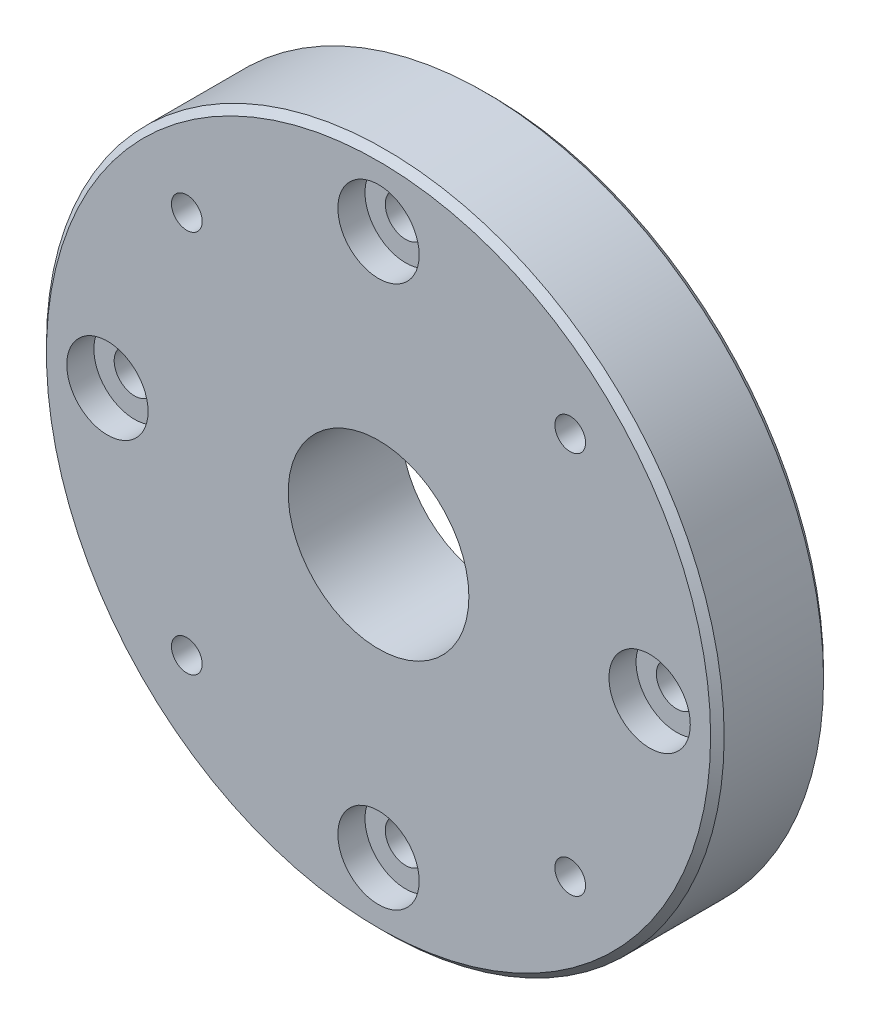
ISO-10303-21;
HEADER;
FILE_DESCRIPTION(('STEP AP214'),'2;1');
FILE_NAME('part.step','',(''),(''),'','','');
FILE_SCHEMA(('AUTOMOTIVE_DESIGN { 1 0 10303 214 1 1 1 1 }'));
ENDSEC;
DATA;
#1=APPLICATION_CONTEXT('core data for automotive mechanical design processes');
#2=APPLICATION_PROTOCOL_DEFINITION('international standard','automotive_design',2000,#1);
#3=PRODUCT_CONTEXT('',#1,'mechanical');
#4=PRODUCT('Part','Part','',(#3));
#5=PRODUCT_RELATED_PRODUCT_CATEGORY('part','',(#4));
#6=PRODUCT_DEFINITION_FORMATION('','',#4);
#7=PRODUCT_DEFINITION_CONTEXT('part definition',#1,'design');
#8=PRODUCT_DEFINITION('design','',#6,#7);
#9=PRODUCT_DEFINITION_SHAPE('','',#8);
#10=(LENGTH_UNIT() NAMED_UNIT(*) SI_UNIT(.MILLI.,.METRE.));
#11=(NAMED_UNIT(*) PLANE_ANGLE_UNIT() SI_UNIT($,.RADIAN.));
#12=(NAMED_UNIT(*) SI_UNIT($,.STERADIAN.) SOLID_ANGLE_UNIT());
#13=UNCERTAINTY_MEASURE_WITH_UNIT(LENGTH_MEASURE(1.E-05),#10,'distance_accuracy_value','');
#14=(GEOMETRIC_REPRESENTATION_CONTEXT(3) GLOBAL_UNCERTAINTY_ASSIGNED_CONTEXT((#13)) GLOBAL_UNIT_ASSIGNED_CONTEXT((#10,
#11,#12)) REPRESENTATION_CONTEXT('',''));
#15=CARTESIAN_POINT('',(0.,0.,0.));
#16=DIRECTION('',(0.,0.,1.));
#17=DIRECTION('',(1.,0.,0.));
#18=AXIS2_PLACEMENT_3D('',#15,#16,#17);
#19=CARTESIAN_POINT('',(0.,0.,25.));
#20=DIRECTION('',(0.,0.,-1.));
#21=DIRECTION('',(-1.,0.,0.));
#22=AXIS2_PLACEMENT_3D('',#19,#20,#21);
#23=CYLINDRICAL_SURFACE('',#22,75.);
#24=CARTESIAN_POINT('',(0.,0.,1.50000000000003));
#25=DIRECTION('',(0.,0.,1.));
#26=DIRECTION('',(1.,0.,0.));
#27=AXIS2_PLACEMENT_3D('',#24,#25,#26);
#28=CIRCLE('',#27,75.);
#29=CARTESIAN_POINT('',(75.,0.,1.50000000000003));
#30=VERTEX_POINT('',#29);
#31=EDGE_CURVE('E60',#30,#30,#28,.T.);
#32=ORIENTED_EDGE('',*,*,#31,.T.);
#33=EDGE_LOOP('',(#32));
#34=FACE_BOUND('',#33,.T.);
#35=CARTESIAN_POINT('',(0.,0.,23.5000000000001));
#36=DIRECTION('',(0.,0.,1.));
#37=DIRECTION('',(1.,0.,0.));
#38=AXIS2_PLACEMENT_3D('',#35,#36,#37);
#39=CIRCLE('',#38,75.);
#40=CARTESIAN_POINT('',(75.,0.,23.5000000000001));
#41=VERTEX_POINT('',#40);
#42=EDGE_CURVE('E64',#41,#41,#39,.F.);
#43=ORIENTED_EDGE('',*,*,#42,.T.);
#44=EDGE_LOOP('',(#43));
#45=FACE_BOUND('',#44,.T.);
#46=ADVANCED_FACE('F48',(#34,#45),#23,.T.);
#47=CARTESIAN_POINT('',(0.,0.,25.));
#48=DIRECTION('',(0.,0.,1.));
#49=DIRECTION('',(1.,0.,0.));
#50=AXIS2_PLACEMENT_3D('',#47,#48,#49);
#51=PLANE('',#50);
#52=CARTESIAN_POINT('',(0.,0.,25.));
#53=DIRECTION('',(0.,0.,1.));
#54=DIRECTION('',(1.,0.,0.));
#55=AXIS2_PLACEMENT_3D('',#52,#53,#54);
#56=CIRCLE('',#55,20.);
#57=CARTESIAN_POINT('',(20.,0.,25.));
#58=VERTEX_POINT('',#57);
#59=EDGE_CURVE('E142',#58,#58,#56,.T.);
#60=ORIENTED_EDGE('',*,*,#59,.F.);
#61=EDGE_LOOP('',(#60));
#62=FACE_BOUND('',#61,.T.);
#63=CARTESIAN_POINT('',(0.,0.,25.));
#64=DIRECTION('',(0.,0.,1.));
#65=DIRECTION('',(1.,0.,0.));
#66=AXIS2_PLACEMENT_3D('',#63,#64,#65);
#67=CIRCLE('',#66,73.5);
#68=CARTESIAN_POINT('',(73.5,0.,25.));
#69=VERTEX_POINT('',#68);
#70=EDGE_CURVE('E12',#69,#69,#67,.T.);
#71=ORIENTED_EDGE('',*,*,#70,.T.);
#72=EDGE_LOOP('',(#71));
#73=FACE_BOUND('',#72,.T.);
#74=CARTESIAN_POINT('',(42.4264068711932,-42.4264068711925,25.));
#75=DIRECTION('',(0.,0.,1.));
#76=DIRECTION('',(1.,0.,0.));
#77=AXIS2_PLACEMENT_3D('',#74,#75,#76);
#78=CIRCLE('',#77,3.4);
#79=CARTESIAN_POINT('',(45.8264068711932,-42.4264068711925,25.));
#80=VERTEX_POINT('',#79);
#81=EDGE_CURVE('E138',#80,#80,#78,.T.);
#82=ORIENTED_EDGE('',*,*,#81,.F.);
#83=EDGE_LOOP('',(#82));
#84=FACE_BOUND('',#83,.T.);
#85=CARTESIAN_POINT('',(-42.4264068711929,-42.4264068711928,25.));
#86=DIRECTION('',(0.,0.,1.));
#87=DIRECTION('',(1.,0.,0.));
#88=AXIS2_PLACEMENT_3D('',#85,#86,#87);
#89=CIRCLE('',#88,3.4);
#90=CARTESIAN_POINT('',(-39.0264068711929,-42.4264068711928,25.));
#91=VERTEX_POINT('',#90);
#92=EDGE_CURVE('E132',#91,#91,#89,.T.);
#93=ORIENTED_EDGE('',*,*,#92,.F.);
#94=EDGE_LOOP('',(#93));
#95=FACE_BOUND('',#94,.T.);
#96=CARTESIAN_POINT('',(-42.4264068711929,42.4264068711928,25.));
#97=DIRECTION('',(0.,0.,1.));
#98=DIRECTION('',(1.,0.,0.));
#99=AXIS2_PLACEMENT_3D('',#96,#97,#98);
#100=CIRCLE('',#99,3.4);
#101=CARTESIAN_POINT('',(-39.0264068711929,42.4264068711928,25.));
#102=VERTEX_POINT('',#101);
#103=EDGE_CURVE('E126',#102,#102,#100,.T.);
#104=ORIENTED_EDGE('',*,*,#103,.F.);
#105=EDGE_LOOP('',(#104));
#106=FACE_BOUND('',#105,.T.);
#107=CARTESIAN_POINT('',(60.,6.28466640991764E-13,25.));
#108=DIRECTION('',(0.,0.,1.));
#109=DIRECTION('',(1.,0.,0.));
#110=AXIS2_PLACEMENT_3D('',#107,#108,#109);
#111=CIRCLE('',#110,8.99999999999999);
#112=CARTESIAN_POINT('',(69.,6.28466640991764E-13,25.));
#113=VERTEX_POINT('',#112);
#114=EDGE_CURVE('E120',#113,#113,#111,.T.);
#115=ORIENTED_EDGE('',*,*,#114,.F.);
#116=EDGE_LOOP('',(#115));
#117=FACE_BOUND('',#116,.T.);
#118=CARTESIAN_POINT('',(0.,-60.,25.));
#119=DIRECTION('',(0.,0.,1.));
#120=DIRECTION('',(1.,0.,0.));
#121=AXIS2_PLACEMENT_3D('',#118,#119,#120);
#122=CIRCLE('',#121,9.);
#123=CARTESIAN_POINT('',(9.,-60.,25.));
#124=VERTEX_POINT('',#123);
#125=EDGE_CURVE('E108',#124,#124,#122,.T.);
#126=ORIENTED_EDGE('',*,*,#125,.F.);
#127=EDGE_LOOP('',(#126));
#128=FACE_BOUND('',#127,.T.);
#129=CARTESIAN_POINT('',(-60.,-2.09488880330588E-13,25.));
#130=DIRECTION('',(0.,0.,1.));
#131=DIRECTION('',(1.,0.,0.));
#132=AXIS2_PLACEMENT_3D('',#129,#130,#131);
#133=CIRCLE('',#132,8.99999999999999);
#134=CARTESIAN_POINT('',(-51.,-2.09488880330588E-13,25.));
#135=VERTEX_POINT('',#134);
#136=EDGE_CURVE('E96',#135,#135,#133,.T.);
#137=ORIENTED_EDGE('',*,*,#136,.F.);
#138=EDGE_LOOP('',(#137));
#139=FACE_BOUND('',#138,.T.);
#140=CARTESIAN_POINT('',(42.4264068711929,42.4264068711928,25.));
#141=DIRECTION('',(0.,0.,1.));
#142=DIRECTION('',(1.,0.,0.));
#143=AXIS2_PLACEMENT_3D('',#140,#141,#142);
#144=CIRCLE('',#143,3.4);
#145=CARTESIAN_POINT('',(45.8264068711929,42.4264068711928,25.));
#146=VERTEX_POINT('',#145);
#147=EDGE_CURVE('E84',#146,#146,#144,.T.);
#148=ORIENTED_EDGE('',*,*,#147,.F.);
#149=EDGE_LOOP('',(#148));
#150=FACE_BOUND('',#149,.T.);
#151=CARTESIAN_POINT('',(0.,60.,25.));
#152=DIRECTION('',(0.,0.,1.));
#153=DIRECTION('',(1.,0.,0.));
#154=AXIS2_PLACEMENT_3D('',#151,#152,#153);
#155=CIRCLE('',#154,9.);
#156=CARTESIAN_POINT('',(9.,60.,25.));
#157=VERTEX_POINT('',#156);
#158=EDGE_CURVE('E78',#157,#157,#155,.T.);
#159=ORIENTED_EDGE('',*,*,#158,.F.);
#160=EDGE_LOOP('',(#159));
#161=FACE_BOUND('',#160,.T.);
#162=ADVANCED_FACE('F156',(#62,#73,#84,#95,#106,#117,#128,#139,#150,#161),#51,.T.);
#163=CARTESIAN_POINT('',(0.,0.,0.));
#164=DIRECTION('',(0.,0.,1.));
#165=DIRECTION('',(1.,0.,0.));
#166=AXIS2_PLACEMENT_3D('',#163,#164,#165);
#167=PLANE('',#166);
#168=CARTESIAN_POINT('',(0.,0.,0.));
#169=DIRECTION('',(0.,0.,1.));
#170=DIRECTION('',(1.,0.,0.));
#171=AXIS2_PLACEMENT_3D('',#168,#169,#170);
#172=CIRCLE('',#171,20.);
#173=CARTESIAN_POINT('',(20.,0.,0.));
#174=VERTEX_POINT('',#173);
#175=EDGE_CURVE('E141',#174,#174,#172,.T.);
#176=ORIENTED_EDGE('',*,*,#175,.T.);
#177=EDGE_LOOP('',(#176));
#178=FACE_BOUND('',#177,.T.);
#179=CARTESIAN_POINT('',(0.,0.,0.));
#180=DIRECTION('',(0.,0.,1.));
#181=DIRECTION('',(1.,0.,0.));
#182=AXIS2_PLACEMENT_3D('',#179,#180,#181);
#183=CIRCLE('',#182,73.5);
#184=CARTESIAN_POINT('',(73.5,0.,0.));
#185=VERTEX_POINT('',#184);
#186=EDGE_CURVE('E56',#185,#185,#183,.F.);
#187=ORIENTED_EDGE('',*,*,#186,.T.);
#188=EDGE_LOOP('',(#187));
#189=FACE_BOUND('',#188,.T.);
#190=CARTESIAN_POINT('',(42.4264068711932,-42.4264068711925,0.));
#191=DIRECTION('',(0.,0.,1.));
#192=DIRECTION('',(1.,0.,0.));
#193=AXIS2_PLACEMENT_3D('',#190,#191,#192);
#194=CIRCLE('',#193,3.39999999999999);
#195=CARTESIAN_POINT('',(45.8264068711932,-42.4264068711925,0.));
#196=VERTEX_POINT('',#195);
#197=EDGE_CURVE('E135',#196,#196,#194,.T.);
#198=ORIENTED_EDGE('',*,*,#197,.T.);
#199=EDGE_LOOP('',(#198));
#200=FACE_BOUND('',#199,.T.);
#201=CARTESIAN_POINT('',(-42.4264068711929,-42.4264068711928,0.));
#202=DIRECTION('',(0.,0.,1.));
#203=DIRECTION('',(1.,0.,0.));
#204=AXIS2_PLACEMENT_3D('',#201,#202,#203);
#205=CIRCLE('',#204,3.4);
#206=CARTESIAN_POINT('',(-39.0264068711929,-42.4264068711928,0.));
#207=VERTEX_POINT('',#206);
#208=EDGE_CURVE('E129',#207,#207,#205,.T.);
#209=ORIENTED_EDGE('',*,*,#208,.T.);
#210=EDGE_LOOP('',(#209));
#211=FACE_BOUND('',#210,.T.);
#212=CARTESIAN_POINT('',(-42.4264068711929,42.4264068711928,0.));
#213=DIRECTION('',(0.,0.,1.));
#214=DIRECTION('',(1.,0.,0.));
#215=AXIS2_PLACEMENT_3D('',#212,#213,#214);
#216=CIRCLE('',#215,3.4);
#217=CARTESIAN_POINT('',(-39.0264068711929,42.4264068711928,0.));
#218=VERTEX_POINT('',#217);
#219=EDGE_CURVE('E123',#218,#218,#216,.T.);
#220=ORIENTED_EDGE('',*,*,#219,.T.);
#221=EDGE_LOOP('',(#220));
#222=FACE_BOUND('',#221,.T.);
#223=CARTESIAN_POINT('',(60.,6.28466640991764E-13,0.));
#224=DIRECTION('',(0.,0.,1.));
#225=DIRECTION('',(1.,0.,0.));
#226=AXIS2_PLACEMENT_3D('',#223,#224,#225);
#227=CIRCLE('',#226,4.49999999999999);
#228=CARTESIAN_POINT('',(64.5,6.28466640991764E-13,0.));
#229=VERTEX_POINT('',#228);
#230=EDGE_CURVE('E111',#229,#229,#227,.T.);
#231=ORIENTED_EDGE('',*,*,#230,.T.);
#232=EDGE_LOOP('',(#231));
#233=FACE_BOUND('',#232,.T.);
#234=CARTESIAN_POINT('',(0.,-60.,0.));
#235=DIRECTION('',(0.,0.,1.));
#236=DIRECTION('',(1.,0.,0.));
#237=AXIS2_PLACEMENT_3D('',#234,#235,#236);
#238=CIRCLE('',#237,4.49999999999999);
#239=CARTESIAN_POINT('',(4.49999999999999,-60.,0.));
#240=VERTEX_POINT('',#239);
#241=EDGE_CURVE('E99',#240,#240,#238,.T.);
#242=ORIENTED_EDGE('',*,*,#241,.T.);
#243=EDGE_LOOP('',(#242));
#244=FACE_BOUND('',#243,.T.);
#245=CARTESIAN_POINT('',(-60.,-2.09488880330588E-13,0.));
#246=DIRECTION('',(0.,0.,1.));
#247=DIRECTION('',(1.,0.,0.));
#248=AXIS2_PLACEMENT_3D('',#245,#246,#247);
#249=CIRCLE('',#248,4.5);
#250=CARTESIAN_POINT('',(-55.5,-2.09488880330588E-13,0.));
#251=VERTEX_POINT('',#250);
#252=EDGE_CURVE('E87',#251,#251,#249,.T.);
#253=ORIENTED_EDGE('',*,*,#252,.T.);
#254=EDGE_LOOP('',(#253));
#255=FACE_BOUND('',#254,.T.);
#256=CARTESIAN_POINT('',(42.4264068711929,42.4264068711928,0.));
#257=DIRECTION('',(0.,0.,1.));
#258=DIRECTION('',(1.,0.,0.));
#259=AXIS2_PLACEMENT_3D('',#256,#257,#258);
#260=CIRCLE('',#259,3.4);
#261=CARTESIAN_POINT('',(45.8264068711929,42.4264068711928,0.));
#262=VERTEX_POINT('',#261);
#263=EDGE_CURVE('E81',#262,#262,#260,.T.);
#264=ORIENTED_EDGE('',*,*,#263,.T.);
#265=EDGE_LOOP('',(#264));
#266=FACE_BOUND('',#265,.T.);
#267=CARTESIAN_POINT('',(0.,60.,0.));
#268=DIRECTION('',(0.,0.,1.));
#269=DIRECTION('',(1.,0.,0.));
#270=AXIS2_PLACEMENT_3D('',#267,#268,#269);
#271=CIRCLE('',#270,4.49999999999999);
#272=CARTESIAN_POINT('',(4.49999999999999,60.,0.));
#273=VERTEX_POINT('',#272);
#274=EDGE_CURVE('E69',#273,#273,#271,.T.);
#275=ORIENTED_EDGE('',*,*,#274,.T.);
#276=EDGE_LOOP('',(#275));
#277=FACE_BOUND('',#276,.T.);
#278=ADVANCED_FACE('F148',(#178,#189,#200,#211,#222,#233,#244,#255,#266,#277),#167,.F.);
#279=CARTESIAN_POINT('',(0.,60.,25.));
#280=DIRECTION('',(0.,0.,1.));
#281=DIRECTION('',(1.,0.,0.));
#282=AXIS2_PLACEMENT_3D('',#279,#280,#281);
#283=CYLINDRICAL_SURFACE('',#282,4.5);
#284=ORIENTED_EDGE('',*,*,#274,.F.);
#285=EDGE_LOOP('',(#284));
#286=FACE_BOUND('',#285,.T.);
#287=CARTESIAN_POINT('',(0.,60.,19.));
#288=DIRECTION('',(0.,0.,1.));
#289=DIRECTION('',(1.,0.,0.));
#290=AXIS2_PLACEMENT_3D('',#287,#288,#289);
#291=CIRCLE('',#290,4.5);
#292=CARTESIAN_POINT('',(4.5,60.,19.));
#293=VERTEX_POINT('',#292);
#294=EDGE_CURVE('E72',#293,#293,#291,.T.);
#295=ORIENTED_EDGE('',*,*,#294,.T.);
#296=EDGE_LOOP('',(#295));
#297=FACE_BOUND('',#296,.T.);
#298=ADVANCED_FACE('F189',(#286,#297),#283,.F.);
#299=CARTESIAN_POINT('',(4.5,60.,19.));
#300=DIRECTION('',(0.,0.,-1.));
#301=DIRECTION('',(-1.,0.,0.));
#302=AXIS2_PLACEMENT_3D('',#299,#300,#301);
#303=PLANE('',#302);
#304=ORIENTED_EDGE('',*,*,#294,.F.);
#305=EDGE_LOOP('',(#304));
#306=FACE_BOUND('',#305,.T.);
#307=CARTESIAN_POINT('',(0.,60.,19.));
#308=DIRECTION('',(0.,0.,1.));
#309=DIRECTION('',(1.,0.,0.));
#310=AXIS2_PLACEMENT_3D('',#307,#308,#309);
#311=CIRCLE('',#310,9.);
#312=CARTESIAN_POINT('',(9.,60.,19.));
#313=VERTEX_POINT('',#312);
#314=EDGE_CURVE('E75',#313,#313,#311,.T.);
#315=ORIENTED_EDGE('',*,*,#314,.T.);
#316=EDGE_LOOP('',(#315));
#317=FACE_BOUND('',#316,.T.);
#318=ADVANCED_FACE('F179',(#306,#317),#303,.F.);
#319=CARTESIAN_POINT('',(0.,60.,25.));
#320=DIRECTION('',(0.,0.,1.));
#321=DIRECTION('',(1.,0.,0.));
#322=AXIS2_PLACEMENT_3D('',#319,#320,#321);
#323=CYLINDRICAL_SURFACE('',#322,9.);
#324=ORIENTED_EDGE('',*,*,#314,.F.);
#325=EDGE_LOOP('',(#324));
#326=FACE_BOUND('',#325,.T.);
#327=ORIENTED_EDGE('',*,*,#158,.T.);
#328=EDGE_LOOP('',(#327));
#329=FACE_BOUND('',#328,.T.);
#330=ADVANCED_FACE('F176',(#326,#329),#323,.F.);
#331=CARTESIAN_POINT('',(42.4264068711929,42.4264068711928,25.));
#332=DIRECTION('',(0.,0.,1.));
#333=DIRECTION('',(1.,0.,0.));
#334=AXIS2_PLACEMENT_3D('',#331,#332,#333);
#335=CYLINDRICAL_SURFACE('',#334,3.4);
#336=ORIENTED_EDGE('',*,*,#263,.F.);
#337=EDGE_LOOP('',(#336));
#338=FACE_BOUND('',#337,.T.);
#339=ORIENTED_EDGE('',*,*,#147,.T.);
#340=EDGE_LOOP('',(#339));
#341=FACE_BOUND('',#340,.T.);
#342=ADVANCED_FACE('F178',(#338,#341),#335,.F.);
#343=CARTESIAN_POINT('',(-60.,-2.09488880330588E-13,25.));
#344=DIRECTION('',(0.,0.,1.));
#345=DIRECTION('',(1.,0.,0.));
#346=AXIS2_PLACEMENT_3D('',#343,#344,#345);
#347=CYLINDRICAL_SURFACE('',#346,4.5);
#348=ORIENTED_EDGE('',*,*,#252,.F.);
#349=EDGE_LOOP('',(#348));
#350=FACE_BOUND('',#349,.T.);
#351=CARTESIAN_POINT('',(-60.,-2.09488880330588E-13,19.));
#352=DIRECTION('',(0.,0.,1.));
#353=DIRECTION('',(1.,0.,0.));
#354=AXIS2_PLACEMENT_3D('',#351,#352,#353);
#355=CIRCLE('',#354,4.5);
#356=CARTESIAN_POINT('',(-55.5,-2.09488880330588E-13,19.));
#357=VERTEX_POINT('',#356);
#358=EDGE_CURVE('E90',#357,#357,#355,.T.);
#359=ORIENTED_EDGE('',*,*,#358,.T.);
#360=EDGE_LOOP('',(#359));
#361=FACE_BOUND('',#360,.T.);
#362=ADVANCED_FACE('F186',(#350,#361),#347,.F.);
#363=CARTESIAN_POINT('',(-55.5,-2.09488880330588E-13,19.));
#364=DIRECTION('',(0.,0.,-1.));
#365=DIRECTION('',(-1.,0.,0.));
#366=AXIS2_PLACEMENT_3D('',#363,#364,#365);
#367=PLANE('',#366);
#368=ORIENTED_EDGE('',*,*,#358,.F.);
#369=EDGE_LOOP('',(#368));
#370=FACE_BOUND('',#369,.T.);
#371=CARTESIAN_POINT('',(-60.,-2.09488880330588E-13,19.));
#372=DIRECTION('',(0.,0.,1.));
#373=DIRECTION('',(1.,0.,0.));
#374=AXIS2_PLACEMENT_3D('',#371,#372,#373);
#375=CIRCLE('',#374,9.);
#376=CARTESIAN_POINT('',(-51.,-2.09488880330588E-13,19.));
#377=VERTEX_POINT('',#376);
#378=EDGE_CURVE('E93',#377,#377,#375,.T.);
#379=ORIENTED_EDGE('',*,*,#378,.T.);
#380=EDGE_LOOP('',(#379));
#381=FACE_BOUND('',#380,.T.);
#382=ADVANCED_FACE('F256',(#370,#381),#367,.F.);
#383=CARTESIAN_POINT('',(-60.,-2.09488880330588E-13,25.));
#384=DIRECTION('',(0.,0.,1.));
#385=DIRECTION('',(1.,0.,0.));
#386=AXIS2_PLACEMENT_3D('',#383,#384,#385);
#387=CYLINDRICAL_SURFACE('',#386,9.);
#388=ORIENTED_EDGE('',*,*,#378,.F.);
#389=EDGE_LOOP('',(#388));
#390=FACE_BOUND('',#389,.T.);
#391=ORIENTED_EDGE('',*,*,#136,.T.);
#392=EDGE_LOOP('',(#391));
#393=FACE_BOUND('',#392,.T.);
#394=ADVANCED_FACE('F252',(#390,#393),#387,.F.);
#395=CARTESIAN_POINT('',(0.,-60.,25.));
#396=DIRECTION('',(0.,0.,1.));
#397=DIRECTION('',(1.,0.,0.));
#398=AXIS2_PLACEMENT_3D('',#395,#396,#397);
#399=CYLINDRICAL_SURFACE('',#398,4.5);
#400=ORIENTED_EDGE('',*,*,#241,.F.);
#401=EDGE_LOOP('',(#400));
#402=FACE_BOUND('',#401,.T.);
#403=CARTESIAN_POINT('',(0.,-60.,19.));
#404=DIRECTION('',(0.,0.,1.));
#405=DIRECTION('',(1.,0.,0.));
#406=AXIS2_PLACEMENT_3D('',#403,#404,#405);
#407=CIRCLE('',#406,4.5);
#408=CARTESIAN_POINT('',(4.5,-60.,19.));
#409=VERTEX_POINT('',#408);
#410=EDGE_CURVE('E102',#409,#409,#407,.T.);
#411=ORIENTED_EDGE('',*,*,#410,.T.);
#412=EDGE_LOOP('',(#411));
#413=FACE_BOUND('',#412,.T.);
#414=ADVANCED_FACE('F248',(#402,#413),#399,.F.);
#415=CARTESIAN_POINT('',(4.5,-60.,19.));
#416=DIRECTION('',(0.,0.,-1.));
#417=DIRECTION('',(-1.,0.,0.));
#418=AXIS2_PLACEMENT_3D('',#415,#416,#417);
#419=PLANE('',#418);
#420=ORIENTED_EDGE('',*,*,#410,.F.);
#421=EDGE_LOOP('',(#420));
#422=FACE_BOUND('',#421,.T.);
#423=CARTESIAN_POINT('',(0.,-60.,19.));
#424=DIRECTION('',(0.,0.,1.));
#425=DIRECTION('',(1.,0.,0.));
#426=AXIS2_PLACEMENT_3D('',#423,#424,#425);
#427=CIRCLE('',#426,9.);
#428=CARTESIAN_POINT('',(9.,-60.,19.));
#429=VERTEX_POINT('',#428);
#430=EDGE_CURVE('E105',#429,#429,#427,.T.);
#431=ORIENTED_EDGE('',*,*,#430,.T.);
#432=EDGE_LOOP('',(#431));
#433=FACE_BOUND('',#432,.T.);
#434=ADVANCED_FACE('F244',(#422,#433),#419,.F.);
#435=CARTESIAN_POINT('',(0.,-60.,25.));
#436=DIRECTION('',(0.,0.,1.));
#437=DIRECTION('',(1.,0.,0.));
#438=AXIS2_PLACEMENT_3D('',#435,#436,#437);
#439=CYLINDRICAL_SURFACE('',#438,9.);
#440=ORIENTED_EDGE('',*,*,#430,.F.);
#441=EDGE_LOOP('',(#440));
#442=FACE_BOUND('',#441,.T.);
#443=ORIENTED_EDGE('',*,*,#125,.T.);
#444=EDGE_LOOP('',(#443));
#445=FACE_BOUND('',#444,.T.);
#446=ADVANCED_FACE('F240',(#442,#445),#439,.F.);
#447=CARTESIAN_POINT('',(60.,6.28466640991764E-13,25.));
#448=DIRECTION('',(0.,0.,1.));
#449=DIRECTION('',(1.,0.,0.));
#450=AXIS2_PLACEMENT_3D('',#447,#448,#449);
#451=CYLINDRICAL_SURFACE('',#450,4.5);
#452=ORIENTED_EDGE('',*,*,#230,.F.);
#453=EDGE_LOOP('',(#452));
#454=FACE_BOUND('',#453,.T.);
#455=CARTESIAN_POINT('',(60.,6.28466640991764E-13,19.));
#456=DIRECTION('',(0.,0.,1.));
#457=DIRECTION('',(1.,0.,0.));
#458=AXIS2_PLACEMENT_3D('',#455,#456,#457);
#459=CIRCLE('',#458,4.5);
#460=CARTESIAN_POINT('',(64.5,6.28466640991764E-13,19.));
#461=VERTEX_POINT('',#460);
#462=EDGE_CURVE('E114',#461,#461,#459,.T.);
#463=ORIENTED_EDGE('',*,*,#462,.T.);
#464=EDGE_LOOP('',(#463));
#465=FACE_BOUND('',#464,.T.);
#466=ADVANCED_FACE('F236',(#454,#465),#451,.F.);
#467=CARTESIAN_POINT('',(64.5,6.28466640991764E-13,19.));
#468=DIRECTION('',(0.,0.,-1.));
#469=DIRECTION('',(-1.,0.,0.));
#470=AXIS2_PLACEMENT_3D('',#467,#468,#469);
#471=PLANE('',#470);
#472=ORIENTED_EDGE('',*,*,#462,.F.);
#473=EDGE_LOOP('',(#472));
#474=FACE_BOUND('',#473,.T.);
#475=CARTESIAN_POINT('',(60.,6.28466640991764E-13,19.));
#476=DIRECTION('',(0.,0.,1.));
#477=DIRECTION('',(1.,0.,0.));
#478=AXIS2_PLACEMENT_3D('',#475,#476,#477);
#479=CIRCLE('',#478,8.99999999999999);
#480=CARTESIAN_POINT('',(69.,6.28466640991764E-13,19.));
#481=VERTEX_POINT('',#480);
#482=EDGE_CURVE('E117',#481,#481,#479,.T.);
#483=ORIENTED_EDGE('',*,*,#482,.T.);
#484=EDGE_LOOP('',(#483));
#485=FACE_BOUND('',#484,.T.);
#486=ADVANCED_FACE('F232',(#474,#485),#471,.F.);
#487=CARTESIAN_POINT('',(60.,6.28466640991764E-13,25.));
#488=DIRECTION('',(0.,0.,1.));
#489=DIRECTION('',(1.,0.,0.));
#490=AXIS2_PLACEMENT_3D('',#487,#488,#489);
#491=CYLINDRICAL_SURFACE('',#490,8.99999999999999);
#492=ORIENTED_EDGE('',*,*,#482,.F.);
#493=EDGE_LOOP('',(#492));
#494=FACE_BOUND('',#493,.T.);
#495=ORIENTED_EDGE('',*,*,#114,.T.);
#496=EDGE_LOOP('',(#495));
#497=FACE_BOUND('',#496,.T.);
#498=ADVANCED_FACE('F228',(#494,#497),#491,.F.);
#499=CARTESIAN_POINT('',(-42.4264068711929,42.4264068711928,25.));
#500=DIRECTION('',(0.,0.,1.));
#501=DIRECTION('',(1.,0.,0.));
#502=AXIS2_PLACEMENT_3D('',#499,#500,#501);
#503=CYLINDRICAL_SURFACE('',#502,3.4);
#504=ORIENTED_EDGE('',*,*,#219,.F.);
#505=EDGE_LOOP('',(#504));
#506=FACE_BOUND('',#505,.T.);
#507=ORIENTED_EDGE('',*,*,#103,.T.);
#508=EDGE_LOOP('',(#507));
#509=FACE_BOUND('',#508,.T.);
#510=ADVANCED_FACE('F220',(#506,#509),#503,.F.);
#511=CARTESIAN_POINT('',(-42.4264068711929,-42.4264068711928,25.));
#512=DIRECTION('',(0.,0.,1.));
#513=DIRECTION('',(1.,0.,0.));
#514=AXIS2_PLACEMENT_3D('',#511,#512,#513);
#515=CYLINDRICAL_SURFACE('',#514,3.4);
#516=ORIENTED_EDGE('',*,*,#208,.F.);
#517=EDGE_LOOP('',(#516));
#518=FACE_BOUND('',#517,.T.);
#519=ORIENTED_EDGE('',*,*,#92,.T.);
#520=EDGE_LOOP('',(#519));
#521=FACE_BOUND('',#520,.T.);
#522=ADVANCED_FACE('F212',(#518,#521),#515,.F.);
#523=CARTESIAN_POINT('',(42.4264068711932,-42.4264068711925,25.));
#524=DIRECTION('',(0.,0.,1.));
#525=DIRECTION('',(1.,0.,0.));
#526=AXIS2_PLACEMENT_3D('',#523,#524,#525);
#527=CYLINDRICAL_SURFACE('',#526,3.4);
#528=ORIENTED_EDGE('',*,*,#197,.F.);
#529=EDGE_LOOP('',(#528));
#530=FACE_BOUND('',#529,.T.);
#531=ORIENTED_EDGE('',*,*,#81,.T.);
#532=EDGE_LOOP('',(#531));
#533=FACE_BOUND('',#532,.T.);
#534=ADVANCED_FACE('F205',(#530,#533),#527,.F.);
#535=CARTESIAN_POINT('',(0.,0.,1.50000000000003));
#536=DIRECTION('',(0.,0.,1.));
#537=DIRECTION('',(1.,0.,0.));
#538=AXIS2_PLACEMENT_3D('',#535,#536,#537);
#539=CONICAL_SURFACE('',#538,75.,0.785398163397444);
#540=ORIENTED_EDGE('',*,*,#186,.F.);
#541=EDGE_LOOP('',(#540));
#542=FACE_BOUND('',#541,.T.);
#543=ORIENTED_EDGE('',*,*,#31,.F.);
#544=EDGE_LOOP('',(#543));
#545=FACE_BOUND('',#544,.T.);
#546=ADVANCED_FACE('F201',(#542,#545),#539,.T.);
#547=CARTESIAN_POINT('',(0.,0.,25.));
#548=DIRECTION('',(0.,0.,-1.));
#549=DIRECTION('',(-1.,0.,0.));
#550=AXIS2_PLACEMENT_3D('',#547,#548,#549);
#551=CONICAL_SURFACE('',#550,73.5,0.785398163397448);
#552=ORIENTED_EDGE('',*,*,#42,.F.);
#553=EDGE_LOOP('',(#552));
#554=FACE_BOUND('',#553,.T.);
#555=ORIENTED_EDGE('',*,*,#70,.F.);
#556=EDGE_LOOP('',(#555));
#557=FACE_BOUND('',#556,.T.);
#558=ADVANCED_FACE('F51',(#554,#557),#551,.T.);
#559=CARTESIAN_POINT('',(0.,0.,0.));
#560=DIRECTION('',(0.,0.,1.));
#561=DIRECTION('',(1.,0.,0.));
#562=AXIS2_PLACEMENT_3D('',#559,#560,#561);
#563=CYLINDRICAL_SURFACE('',#562,20.);
#564=ORIENTED_EDGE('',*,*,#175,.F.);
#565=EDGE_LOOP('',(#564));
#566=FACE_BOUND('',#565,.T.);
#567=ORIENTED_EDGE('',*,*,#59,.T.);
#568=EDGE_LOOP('',(#567));
#569=FACE_BOUND('',#568,.T.);
#570=ADVANCED_FACE('F150',(#566,#569),#563,.F.);
#571=CLOSED_SHELL('',(#46,#162,#278,#298,#318,#330,#342,#362,#382,#394,#414,#434,#446,#466,#486,
#498,#510,#522,#534,#546,#558,#570));
#572=MANIFOLD_SOLID_BREP('B2',#571);
#573=ADVANCED_BREP_SHAPE_REPRESENTATION('',(#18,#572),#14);
#574=SHAPE_DEFINITION_REPRESENTATION(#9,#573);
ENDSEC;
END-ISO-10303-21;
